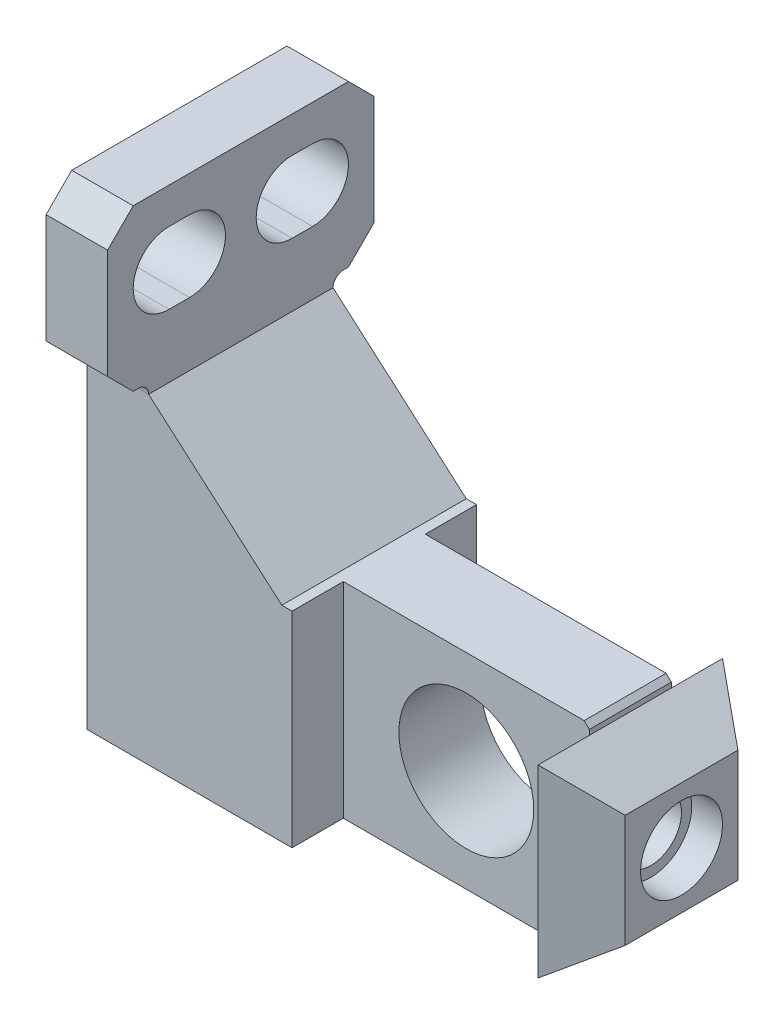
ISO-10303-21;
HEADER;
FILE_DESCRIPTION(('STEP AP214'),'2;1');
FILE_NAME('part.step','',(''),(''),'','','');
FILE_SCHEMA(('AUTOMOTIVE_DESIGN { 1 0 10303 214 1 1 1 1 }'));
ENDSEC;
DATA;
#1=APPLICATION_CONTEXT('core data for automotive mechanical design processes');
#2=APPLICATION_PROTOCOL_DEFINITION('international standard','automotive_design',2000,#1);
#3=PRODUCT_CONTEXT('',#1,'mechanical');
#4=PRODUCT('Part','Part','',(#3));
#5=PRODUCT_RELATED_PRODUCT_CATEGORY('part','',(#4));
#6=PRODUCT_DEFINITION_FORMATION('','',#4);
#7=PRODUCT_DEFINITION_CONTEXT('part definition',#1,'design');
#8=PRODUCT_DEFINITION('design','',#6,#7);
#9=PRODUCT_DEFINITION_SHAPE('','',#8);
#10=(LENGTH_UNIT() NAMED_UNIT(*) SI_UNIT(.MILLI.,.METRE.));
#11=(NAMED_UNIT(*) PLANE_ANGLE_UNIT() SI_UNIT($,.RADIAN.));
#12=(NAMED_UNIT(*) SI_UNIT($,.STERADIAN.) SOLID_ANGLE_UNIT());
#13=UNCERTAINTY_MEASURE_WITH_UNIT(LENGTH_MEASURE(1.E-05),#10,'distance_accuracy_value','');
#14=(GEOMETRIC_REPRESENTATION_CONTEXT(3) GLOBAL_UNCERTAINTY_ASSIGNED_CONTEXT((#13)) GLOBAL_UNIT_ASSIGNED_CONTEXT((#10,
#11,#12)) REPRESENTATION_CONTEXT('',''));
#15=CARTESIAN_POINT('',(0.,0.,0.));
#16=DIRECTION('',(0.,0.,1.));
#17=DIRECTION('',(1.,0.,0.));
#18=AXIS2_PLACEMENT_3D('',#15,#16,#17);
#19=CARTESIAN_POINT('',(12.,-9.5,4.));
#20=DIRECTION('',(-1.,0.,0.));
#21=DIRECTION('',(0.,0.,1.));
#22=AXIS2_PLACEMENT_3D('',#19,#20,#21);
#23=PLANE('',#22);
#24=DIRECTION('',(0.,0.,-1.));
#25=VECTOR('',#24,1.);
#26=CARTESIAN_POINT('',(12.,-9.,9.));
#27=LINE('',#26,#25);
#28=CARTESIAN_POINT('',(12.,-9.,4.));
#29=VERTEX_POINT('',#28);
#30=CARTESIAN_POINT('',(12.,-9.,-4.));
#31=VERTEX_POINT('',#30);
#32=EDGE_CURVE('E44',#29,#31,#27,.T.);
#33=ORIENTED_EDGE('',*,*,#32,.F.);
#34=DIRECTION('',(0.,1.,0.));
#35=VECTOR('',#34,1.);
#36=CARTESIAN_POINT('',(12.,-9.5,4.));
#37=LINE('',#36,#35);
#38=CARTESIAN_POINT('',(12.,-9.5,4.));
#39=VERTEX_POINT('',#38);
#40=EDGE_CURVE('E540',#39,#29,#37,.T.);
#41=ORIENTED_EDGE('',*,*,#40,.F.);
#42=DIRECTION('',(0.,0.,-1.));
#43=VECTOR('',#42,1.);
#44=CARTESIAN_POINT('',(12.,-9.5,4.));
#45=LINE('',#44,#43);
#46=CARTESIAN_POINT('',(12.,-9.5,-4.));
#47=VERTEX_POINT('',#46);
#48=EDGE_CURVE('E552',#39,#47,#45,.T.);
#49=ORIENTED_EDGE('',*,*,#48,.T.);
#50=DIRECTION('',(0.,1.,0.));
#51=VECTOR('',#50,1.);
#52=CARTESIAN_POINT('',(12.,-9.5,-4.));
#53=LINE('',#52,#51);
#54=EDGE_CURVE('E524',#47,#31,#53,.T.);
#55=ORIENTED_EDGE('',*,*,#54,.T.);
#56=EDGE_LOOP('',(#33,#41,#49,#55));
#57=FACE_BOUND('',#56,.T.);
#58=ADVANCED_FACE('F35',(#57),#23,.F.);
#59=CARTESIAN_POINT('',(-12.,-10.,4.));
#60=DIRECTION('',(0.,1.,0.));
#61=DIRECTION('',(0.,0.,1.));
#62=AXIS2_PLACEMENT_3D('',#59,#60,#61);
#63=PLANE('',#62);
#64=DIRECTION('',(1.,0.,0.));
#65=VECTOR('',#64,1.);
#66=CARTESIAN_POINT('',(-12.,-10.,4.));
#67=LINE('',#66,#65);
#68=CARTESIAN_POINT('',(-12.,-10.,4.));
#69=VERTEX_POINT('',#68);
#70=CARTESIAN_POINT('',(11.5,-10.,4.));
#71=VERTEX_POINT('',#70);
#72=EDGE_CURVE('E536',#69,#71,#67,.T.);
#73=ORIENTED_EDGE('',*,*,#72,.F.);
#74=DIRECTION('',(0.,0.,-1.));
#75=VECTOR('',#74,1.);
#76=CARTESIAN_POINT('',(-12.,-10.,9.));
#77=LINE('',#76,#75);
#78=CARTESIAN_POINT('',(-12.,-10.,9.));
#79=VERTEX_POINT('',#78);
#80=EDGE_CURVE('E460',#79,#69,#77,.T.);
#81=ORIENTED_EDGE('',*,*,#80,.F.);
#82=DIRECTION('',(1.,0.,0.));
#83=VECTOR('',#82,1.);
#84=CARTESIAN_POINT('',(-32.,-10.,9.));
#85=LINE('',#84,#83);
#86=CARTESIAN_POINT('',(-32.,-10.,9.));
#87=VERTEX_POINT('',#86);
#88=EDGE_CURVE('E442',#87,#79,#85,.T.);
#89=ORIENTED_EDGE('',*,*,#88,.F.);
#90=DIRECTION('',(0.,0.,-1.));
#91=VECTOR('',#90,1.);
#92=CARTESIAN_POINT('',(-32.,-10.,9.));
#93=LINE('',#92,#91);
#94=CARTESIAN_POINT('',(-32.,-10.,-9.));
#95=VERTEX_POINT('',#94);
#96=EDGE_CURVE('E462',#87,#95,#93,.T.);
#97=ORIENTED_EDGE('',*,*,#96,.T.);
#98=DIRECTION('',(1.,0.,0.));
#99=VECTOR('',#98,1.);
#100=CARTESIAN_POINT('',(-32.,-10.,-9.));
#101=LINE('',#100,#99);
#102=CARTESIAN_POINT('',(-12.,-10.,-9.));
#103=VERTEX_POINT('',#102);
#104=EDGE_CURVE('E425',#95,#103,#101,.T.);
#105=ORIENTED_EDGE('',*,*,#104,.T.);
#106=CARTESIAN_POINT('',(-12.,-10.,-4.));
#107=VERTEX_POINT('',#106);
#108=EDGE_CURVE('E459',#107,#103,#77,.T.);
#109=ORIENTED_EDGE('',*,*,#108,.F.);
#110=DIRECTION('',(1.,0.,0.));
#111=VECTOR('',#110,1.);
#112=CARTESIAN_POINT('',(-12.,-10.,-4.));
#113=LINE('',#112,#111);
#114=CARTESIAN_POINT('',(11.5,-10.,-4.));
#115=VERTEX_POINT('',#114);
#116=EDGE_CURVE('E517',#107,#115,#113,.T.);
#117=ORIENTED_EDGE('',*,*,#116,.T.);
#118=DIRECTION('',(0.,0.,-1.));
#119=VECTOR('',#118,1.);
#120=CARTESIAN_POINT('',(11.5,-10.,4.));
#121=LINE('',#120,#119);
#122=EDGE_CURVE('E39',#71,#115,#121,.T.);
#123=ORIENTED_EDGE('',*,*,#122,.F.);
#124=EDGE_LOOP('',(#73,#81,#89,#97,#105,#109,#117,#123));
#125=FACE_BOUND('',#124,.T.);
#126=ADVANCED_FACE('F37',(#125),#63,.F.);
#127=CARTESIAN_POINT('',(11.5,-10.,4.));
#128=DIRECTION('',(-0.707106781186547,0.707106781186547,0.));
#129=DIRECTION('',(-0.707106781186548,-0.707106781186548,0.));
#130=AXIS2_PLACEMENT_3D('',#127,#128,#129);
#131=PLANE('',#130);
#132=ORIENTED_EDGE('',*,*,#122,.T.);
#133=DIRECTION('',(0.707106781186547,0.707106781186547,0.));
#134=VECTOR('',#133,1.);
#135=CARTESIAN_POINT('',(11.5,-10.,-4.));
#136=LINE('',#135,#134);
#137=EDGE_CURVE('E520',#115,#47,#136,.T.);
#138=ORIENTED_EDGE('',*,*,#137,.T.);
#139=ORIENTED_EDGE('',*,*,#48,.F.);
#140=DIRECTION('',(0.707106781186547,0.707106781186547,0.));
#141=VECTOR('',#140,1.);
#142=CARTESIAN_POINT('',(11.5,-10.,4.));
#143=LINE('',#142,#141);
#144=EDGE_CURVE('E538',#71,#39,#143,.T.);
#145=ORIENTED_EDGE('',*,*,#144,.F.);
#146=EDGE_LOOP('',(#132,#138,#139,#145));
#147=FACE_BOUND('',#146,.T.);
#148=ADVANCED_FACE('F609',(#147),#131,.F.);
#149=CARTESIAN_POINT('',(12.,9.,4.));
#150=VERTEX_POINT('',#149);
#151=CARTESIAN_POINT('',(12.,9.5,4.));
#152=VERTEX_POINT('',#151);
#153=EDGE_CURVE('E53',#150,#152,#37,.T.);
#154=ORIENTED_EDGE('',*,*,#153,.F.);
#155=DIRECTION('',(0.,0.,-1.));
#156=VECTOR('',#155,1.);
#157=CARTESIAN_POINT('',(12.,9.,9.));
#158=LINE('',#157,#156);
#159=CARTESIAN_POINT('',(12.,9.,-4.));
#160=VERTEX_POINT('',#159);
#161=EDGE_CURVE('E11',#150,#160,#158,.T.);
#162=ORIENTED_EDGE('',*,*,#161,.T.);
#163=CARTESIAN_POINT('',(12.,9.5,-4.));
#164=VERTEX_POINT('',#163);
#165=EDGE_CURVE('E523',#160,#164,#53,.T.);
#166=ORIENTED_EDGE('',*,*,#165,.T.);
#167=DIRECTION('',(0.,0.,-1.));
#168=VECTOR('',#167,1.);
#169=CARTESIAN_POINT('',(12.,9.5,4.));
#170=LINE('',#169,#168);
#171=EDGE_CURVE('E550',#152,#164,#170,.T.);
#172=ORIENTED_EDGE('',*,*,#171,.F.);
#173=EDGE_LOOP('',(#154,#162,#166,#172));
#174=FACE_BOUND('',#173,.T.);
#175=ADVANCED_FACE('F589',(#174),#23,.F.);
#176=CARTESIAN_POINT('',(12.,9.5,4.));
#177=DIRECTION('',(-0.707106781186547,-0.707106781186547,0.));
#178=DIRECTION('',(0.707106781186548,-0.707106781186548,0.));
#179=AXIS2_PLACEMENT_3D('',#176,#177,#178);
#180=PLANE('',#179);
#181=ORIENTED_EDGE('',*,*,#171,.T.);
#182=DIRECTION('',(-0.707106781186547,0.707106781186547,0.));
#183=VECTOR('',#182,1.);
#184=CARTESIAN_POINT('',(12.,9.5,-4.));
#185=LINE('',#184,#183);
#186=CARTESIAN_POINT('',(11.5,10.,-4.));
#187=VERTEX_POINT('',#186);
#188=EDGE_CURVE('E526',#164,#187,#185,.T.);
#189=ORIENTED_EDGE('',*,*,#188,.T.);
#190=DIRECTION('',(0.,0.,-1.));
#191=VECTOR('',#190,1.);
#192=CARTESIAN_POINT('',(11.5,10.,4.));
#193=LINE('',#192,#191);
#194=CARTESIAN_POINT('',(11.5,10.,4.));
#195=VERTEX_POINT('',#194);
#196=EDGE_CURVE('E548',#195,#187,#193,.T.);
#197=ORIENTED_EDGE('',*,*,#196,.F.);
#198=DIRECTION('',(-0.707106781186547,0.707106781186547,0.));
#199=VECTOR('',#198,1.);
#200=CARTESIAN_POINT('',(12.,9.5,4.));
#201=LINE('',#200,#199);
#202=EDGE_CURVE('E542',#152,#195,#201,.T.);
#203=ORIENTED_EDGE('',*,*,#202,.F.);
#204=EDGE_LOOP('',(#181,#189,#197,#203));
#205=FACE_BOUND('',#204,.T.);
#206=ADVANCED_FACE('F593',(#205),#180,.F.);
#207=CARTESIAN_POINT('',(11.5,10.,4.));
#208=DIRECTION('',(0.,-1.,0.));
#209=DIRECTION('',(0.,0.,-1.));
#210=AXIS2_PLACEMENT_3D('',#207,#208,#209);
#211=PLANE('',#210);
#212=ORIENTED_EDGE('',*,*,#196,.T.);
#213=DIRECTION('',(-1.,0.,0.));
#214=VECTOR('',#213,1.);
#215=CARTESIAN_POINT('',(11.5,10.,-4.));
#216=LINE('',#215,#214);
#217=CARTESIAN_POINT('',(-12.,10.,-4.));
#218=VERTEX_POINT('',#217);
#219=EDGE_CURVE('E530',#187,#218,#216,.T.);
#220=ORIENTED_EDGE('',*,*,#219,.T.);
#221=DIRECTION('',(0.,0.,-1.));
#222=VECTOR('',#221,1.);
#223=CARTESIAN_POINT('',(-12.,10.,9.));
#224=LINE('',#223,#222);
#225=CARTESIAN_POINT('',(-12.,10.,-9.));
#226=VERTEX_POINT('',#225);
#227=EDGE_CURVE('E455',#218,#226,#224,.T.);
#228=ORIENTED_EDGE('',*,*,#227,.T.);
#229=DIRECTION('',(-1.,0.,0.));
#230=VECTOR('',#229,1.);
#231=CARTESIAN_POINT('',(-12.,10.,-9.));
#232=LINE('',#231,#230);
#233=CARTESIAN_POINT('',(-13.,10.,-9.));
#234=VERTEX_POINT('',#233);
#235=EDGE_CURVE('E431',#226,#234,#232,.T.);
#236=ORIENTED_EDGE('',*,*,#235,.T.);
#237=DIRECTION('',(0.,0.,-1.));
#238=VECTOR('',#237,1.);
#239=CARTESIAN_POINT('',(-13.,10.,9.));
#240=LINE('',#239,#238);
#241=CARTESIAN_POINT('',(-13.,10.,9.));
#242=VERTEX_POINT('',#241);
#243=EDGE_CURVE('E453',#242,#234,#240,.T.);
#244=ORIENTED_EDGE('',*,*,#243,.F.);
#245=DIRECTION('',(-1.,0.,0.));
#246=VECTOR('',#245,1.);
#247=CARTESIAN_POINT('',(-12.,10.,9.));
#248=LINE('',#247,#246);
#249=CARTESIAN_POINT('',(-12.,10.,9.));
#250=VERTEX_POINT('',#249);
#251=EDGE_CURVE('E446',#250,#242,#248,.T.);
#252=ORIENTED_EDGE('',*,*,#251,.F.);
#253=CARTESIAN_POINT('',(-12.,10.,4.));
#254=VERTEX_POINT('',#253);
#255=EDGE_CURVE('E456',#250,#254,#224,.T.);
#256=ORIENTED_EDGE('',*,*,#255,.T.);
#257=DIRECTION('',(-1.,0.,0.));
#258=VECTOR('',#257,1.);
#259=CARTESIAN_POINT('',(11.5,10.,4.));
#260=LINE('',#259,#258);
#261=EDGE_CURVE('E545',#195,#254,#260,.T.);
#262=ORIENTED_EDGE('',*,*,#261,.F.);
#263=EDGE_LOOP('',(#212,#220,#228,#236,#244,#252,#256,#262));
#264=FACE_BOUND('',#263,.T.);
#265=ADVANCED_FACE('F597',(#264),#211,.F.);
#266=CARTESIAN_POINT('',(0.,0.,4.));
#267=DIRECTION('',(0.,0.,1.));
#268=DIRECTION('',(1.,0.,0.));
#269=AXIS2_PLACEMENT_3D('',#266,#267,#268);
#270=PLANE('',#269);
#271=CARTESIAN_POINT('',(0.,0.,4.));
#272=DIRECTION('',(0.,0.,1.));
#273=DIRECTION('',(1.,0.,0.));
#274=AXIS2_PLACEMENT_3D('',#271,#272,#273);
#275=CIRCLE('',#274,6.5785);
#276=CARTESIAN_POINT('',(6.5785,0.,4.));
#277=VERTEX_POINT('',#276);
#278=EDGE_CURVE('E512',#277,#277,#275,.T.);
#279=ORIENTED_EDGE('',*,*,#278,.F.);
#280=EDGE_LOOP('',(#279));
#281=FACE_BOUND('',#280,.T.);
#282=DIRECTION('',(0.,-1.,0.));
#283=VECTOR('',#282,1.);
#284=CARTESIAN_POINT('',(-12.,10.,4.));
#285=LINE('',#284,#283);
#286=EDGE_CURVE('E533',#254,#69,#285,.T.);
#287=ORIENTED_EDGE('',*,*,#286,.T.);
#288=ORIENTED_EDGE('',*,*,#72,.T.);
#289=ORIENTED_EDGE('',*,*,#144,.T.);
#290=ORIENTED_EDGE('',*,*,#40,.T.);
#291=EDGE_CURVE('E543',#29,#150,#37,.T.);
#292=ORIENTED_EDGE('',*,*,#291,.T.);
#293=ORIENTED_EDGE('',*,*,#153,.T.);
#294=ORIENTED_EDGE('',*,*,#202,.T.);
#295=ORIENTED_EDGE('',*,*,#261,.T.);
#296=EDGE_LOOP('',(#287,#288,#289,#290,#292,#293,#294,#295));
#297=FACE_BOUND('',#296,.T.);
#298=ADVANCED_FACE('F586',(#281,#297),#270,.T.);
#299=CARTESIAN_POINT('',(0.,0.,-4.));
#300=DIRECTION('',(0.,0.,1.));
#301=DIRECTION('',(1.,0.,0.));
#302=AXIS2_PLACEMENT_3D('',#299,#300,#301);
#303=PLANE('',#302);
#304=CARTESIAN_POINT('',(0.,0.,-4.));
#305=DIRECTION('',(0.,0.,1.));
#306=DIRECTION('',(1.,0.,0.));
#307=AXIS2_PLACEMENT_3D('',#304,#305,#306);
#308=CIRCLE('',#307,6.5785);
#309=CARTESIAN_POINT('',(6.5785,0.,-4.));
#310=VERTEX_POINT('',#309);
#311=EDGE_CURVE('E509',#310,#310,#308,.T.);
#312=ORIENTED_EDGE('',*,*,#311,.T.);
#313=EDGE_LOOP('',(#312));
#314=FACE_BOUND('',#313,.T.);
#315=DIRECTION('',(0.,-1.,0.));
#316=VECTOR('',#315,1.);
#317=CARTESIAN_POINT('',(-12.,10.,-4.));
#318=LINE('',#317,#316);
#319=EDGE_CURVE('E515',#218,#107,#318,.T.);
#320=ORIENTED_EDGE('',*,*,#319,.F.);
#321=ORIENTED_EDGE('',*,*,#219,.F.);
#322=ORIENTED_EDGE('',*,*,#188,.F.);
#323=ORIENTED_EDGE('',*,*,#165,.F.);
#324=EDGE_CURVE('E527',#31,#160,#53,.T.);
#325=ORIENTED_EDGE('',*,*,#324,.F.);
#326=ORIENTED_EDGE('',*,*,#54,.F.);
#327=ORIENTED_EDGE('',*,*,#137,.F.);
#328=ORIENTED_EDGE('',*,*,#116,.F.);
#329=EDGE_LOOP('',(#320,#321,#322,#323,#325,#326,#327,#328));
#330=FACE_BOUND('',#329,.T.);
#331=ADVANCED_FACE('F860',(#314,#330),#303,.F.);
#332=CARTESIAN_POINT('',(0.,0.,-4.));
#333=DIRECTION('',(0.,0.,1.));
#334=DIRECTION('',(1.,0.,0.));
#335=AXIS2_PLACEMENT_3D('',#332,#333,#334);
#336=CYLINDRICAL_SURFACE('',#335,6.5785);
#337=ORIENTED_EDGE('',*,*,#278,.T.);
#338=EDGE_LOOP('',(#337));
#339=FACE_BOUND('',#338,.T.);
#340=ORIENTED_EDGE('',*,*,#311,.F.);
#341=EDGE_LOOP('',(#340));
#342=FACE_BOUND('',#341,.T.);
#343=ADVANCED_FACE('F853',(#339,#342),#336,.F.);
#344=CARTESIAN_POINT('',(12.,9.,9.));
#345=DIRECTION('',(1.,0.,0.));
#346=DIRECTION('',(0.,0.,-1.));
#347=AXIS2_PLACEMENT_3D('',#344,#345,#346);
#348=PLANE('',#347);
#349=CARTESIAN_POINT('',(12.,-9.,-9.));
#350=VERTEX_POINT('',#349);
#351=EDGE_CURVE('E504',#31,#350,#27,.T.);
#352=ORIENTED_EDGE('',*,*,#351,.F.);
#353=ORIENTED_EDGE('',*,*,#324,.T.);
#354=CARTESIAN_POINT('',(12.,9.,-9.));
#355=VERTEX_POINT('',#354);
#356=EDGE_CURVE('E47',#160,#355,#158,.T.);
#357=ORIENTED_EDGE('',*,*,#356,.T.);
#358=DIRECTION('',(0.,-1.,0.));
#359=VECTOR('',#358,1.);
#360=CARTESIAN_POINT('',(12.,9.,-9.));
#361=LINE('',#360,#359);
#362=EDGE_CURVE('E493',#355,#350,#361,.T.);
#363=ORIENTED_EDGE('',*,*,#362,.T.);
#364=EDGE_LOOP('',(#352,#353,#357,#363));
#365=FACE_BOUND('',#364,.T.);
#366=ADVANCED_FACE('F567',(#365),#348,.F.);
#367=CARTESIAN_POINT('',(17.,5.50000000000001,9.));
#368=DIRECTION('',(-0.573462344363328,-0.819231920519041,0.));
#369=DIRECTION('',(0.819231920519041,-0.573462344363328,0.));
#370=AXIS2_PLACEMENT_3D('',#367,#368,#369);
#371=PLANE('',#370);
#372=CARTESIAN_POINT('',(12.,9.,9.));
#373=VERTEX_POINT('',#372);
#374=EDGE_CURVE('E46',#373,#150,#158,.T.);
#375=ORIENTED_EDGE('',*,*,#374,.F.);
#376=DIRECTION('',(0.710669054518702,-0.49746833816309,-0.497468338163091));
#377=VECTOR('',#376,1.);
#378=CARTESIAN_POINT('',(15.7626262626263,6.36616161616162,6.36616161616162));
#379=LINE('',#378,#377);
#380=CARTESIAN_POINT('',(17.,5.50000000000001,5.5));
#381=VERTEX_POINT('',#380);
#382=EDGE_CURVE('E490',#373,#381,#379,.T.);
#383=ORIENTED_EDGE('',*,*,#382,.T.);
#384=DIRECTION('',(0.,0.,-1.));
#385=VECTOR('',#384,1.);
#386=CARTESIAN_POINT('',(17.,5.50000000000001,9.));
#387=LINE('',#386,#385);
#388=CARTESIAN_POINT('',(17.,5.50000000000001,-5.50000000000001));
#389=VERTEX_POINT('',#388);
#390=EDGE_CURVE('E498',#381,#389,#387,.T.);
#391=ORIENTED_EDGE('',*,*,#390,.T.);
#392=DIRECTION('',(-0.710669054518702,0.49746833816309,-0.49746833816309));
#393=VECTOR('',#392,1.);
#394=CARTESIAN_POINT('',(22.1262626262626,1.91161616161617,-1.91161616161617));
#395=LINE('',#394,#393);
#396=EDGE_CURVE('E484',#389,#355,#395,.T.);
#397=ORIENTED_EDGE('',*,*,#396,.T.);
#398=ORIENTED_EDGE('',*,*,#356,.F.);
#399=ORIENTED_EDGE('',*,*,#161,.F.);
#400=EDGE_LOOP('',(#375,#383,#391,#397,#398,#399));
#401=FACE_BOUND('',#400,.T.);
#402=ADVANCED_FACE('F573',(#401),#371,.F.);
#403=ORIENTED_EDGE('',*,*,#291,.F.);
#404=CARTESIAN_POINT('',(12.,-9.,9.));
#405=VERTEX_POINT('',#404);
#406=EDGE_CURVE('E505',#405,#29,#27,.T.);
#407=ORIENTED_EDGE('',*,*,#406,.F.);
#408=DIRECTION('',(0.,-1.,0.));
#409=VECTOR('',#408,1.);
#410=CARTESIAN_POINT('',(12.,9.,9.));
#411=LINE('',#410,#409);
#412=EDGE_CURVE('E496',#373,#405,#411,.T.);
#413=ORIENTED_EDGE('',*,*,#412,.F.);
#414=ORIENTED_EDGE('',*,*,#374,.T.);
#415=EDGE_LOOP('',(#403,#407,#413,#414));
#416=FACE_BOUND('',#415,.T.);
#417=ADVANCED_FACE('F584',(#416),#348,.F.);
#418=CARTESIAN_POINT('',(12.,-9.,9.));
#419=DIRECTION('',(-0.573462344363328,0.81923192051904,0.));
#420=DIRECTION('',(-0.81923192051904,-0.573462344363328,0.));
#421=AXIS2_PLACEMENT_3D('',#418,#419,#420);
#422=PLANE('',#421);
#423=DIRECTION('',(0.,0.,-1.));
#424=VECTOR('',#423,1.);
#425=CARTESIAN_POINT('',(17.,-5.5,9.));
#426=LINE('',#425,#424);
#427=CARTESIAN_POINT('',(17.,-5.5,5.5));
#428=VERTEX_POINT('',#427);
#429=CARTESIAN_POINT('',(17.,-5.5,-5.50000000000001));
#430=VERTEX_POINT('',#429);
#431=EDGE_CURVE('E501',#428,#430,#426,.T.);
#432=ORIENTED_EDGE('',*,*,#431,.F.);
#433=DIRECTION('',(-0.710669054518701,-0.497468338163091,0.497468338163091));
#434=VECTOR('',#433,1.);
#435=CARTESIAN_POINT('',(12.,-9.,9.));
#436=LINE('',#435,#434);
#437=EDGE_CURVE('E487',#428,#405,#436,.T.);
#438=ORIENTED_EDGE('',*,*,#437,.T.);
#439=ORIENTED_EDGE('',*,*,#406,.T.);
#440=ORIENTED_EDGE('',*,*,#32,.T.);
#441=ORIENTED_EDGE('',*,*,#351,.T.);
#442=DIRECTION('',(0.710669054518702,0.497468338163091,0.49746833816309));
#443=VECTOR('',#442,1.);
#444=CARTESIAN_POINT('',(18.3636363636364,-4.54545454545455,-4.54545454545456));
#445=LINE('',#444,#443);
#446=EDGE_CURVE('E479',#350,#430,#445,.T.);
#447=ORIENTED_EDGE('',*,*,#446,.T.);
#448=EDGE_LOOP('',(#432,#438,#439,#440,#441,#447));
#449=FACE_BOUND('',#448,.T.);
#450=ADVANCED_FACE('F563',(#449),#422,.F.);
#451=CARTESIAN_POINT('',(17.,-5.5,9.));
#452=DIRECTION('',(-1.,0.,0.));
#453=DIRECTION('',(0.,0.,1.));
#454=AXIS2_PLACEMENT_3D('',#451,#452,#453);
#455=PLANE('',#454);
#456=CARTESIAN_POINT('',(17.,0.,0.));
#457=DIRECTION('',(-1.,0.,0.));
#458=DIRECTION('',(0.,0.,1.));
#459=AXIS2_PLACEMENT_3D('',#456,#457,#458);
#460=CIRCLE('',#459,4.);
#461=CARTESIAN_POINT('',(17.,0.,4.));
#462=VERTEX_POINT('',#461);
#463=EDGE_CURVE('E464',#462,#462,#460,.T.);
#464=ORIENTED_EDGE('',*,*,#463,.T.);
#465=EDGE_LOOP('',(#464));
#466=FACE_BOUND('',#465,.T.);
#467=ORIENTED_EDGE('',*,*,#390,.F.);
#468=DIRECTION('',(0.,1.,0.));
#469=VECTOR('',#468,1.);
#470=CARTESIAN_POINT('',(17.,-9.,5.5));
#471=LINE('',#470,#469);
#472=EDGE_CURVE('E477',#428,#381,#471,.T.);
#473=ORIENTED_EDGE('',*,*,#472,.F.);
#474=ORIENTED_EDGE('',*,*,#431,.T.);
#475=DIRECTION('',(0.,1.,0.));
#476=VECTOR('',#475,1.);
#477=CARTESIAN_POINT('',(17.,-9.,-5.50000000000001));
#478=LINE('',#477,#476);
#479=EDGE_CURVE('E476',#430,#389,#478,.T.);
#480=ORIENTED_EDGE('',*,*,#479,.T.);
#481=EDGE_LOOP('',(#467,#473,#474,#480));
#482=FACE_BOUND('',#481,.T.);
#483=ADVANCED_FACE('F578',(#466,#482),#455,.F.);
#484=CARTESIAN_POINT('',(12.,-9.,-9.));
#485=DIRECTION('',(-0.573462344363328,0.,0.819231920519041));
#486=DIRECTION('',(0.819231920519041,0.,0.573462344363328));
#487=AXIS2_PLACEMENT_3D('',#484,#485,#486);
#488=PLANE('',#487);
#489=ORIENTED_EDGE('',*,*,#479,.F.);
#490=ORIENTED_EDGE('',*,*,#446,.F.);
#491=ORIENTED_EDGE('',*,*,#362,.F.);
#492=ORIENTED_EDGE('',*,*,#396,.F.);
#493=EDGE_LOOP('',(#489,#490,#491,#492));
#494=FACE_BOUND('',#493,.T.);
#495=ADVANCED_FACE('F570',(#494),#488,.F.);
#496=CARTESIAN_POINT('',(17.,-9.,5.5));
#497=DIRECTION('',(-0.573462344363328,0.,-0.81923192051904));
#498=DIRECTION('',(-0.81923192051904,0.,0.573462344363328));
#499=AXIS2_PLACEMENT_3D('',#496,#497,#498);
#500=PLANE('',#499);
#501=ORIENTED_EDGE('',*,*,#412,.T.);
#502=ORIENTED_EDGE('',*,*,#437,.F.);
#503=ORIENTED_EDGE('',*,*,#472,.T.);
#504=ORIENTED_EDGE('',*,*,#382,.F.);
#505=EDGE_LOOP('',(#501,#502,#503,#504));
#506=FACE_BOUND('',#505,.T.);
#507=ADVANCED_FACE('F637',(#506),#500,.F.);
#508=CARTESIAN_POINT('',(9.,0.,0.));
#509=DIRECTION('',(1.,0.,0.));
#510=DIRECTION('',(0.,0.,-1.));
#511=AXIS2_PLACEMENT_3D('',#508,#509,#510);
#512=PLANE('',#511);
#513=CARTESIAN_POINT('',(9.,0.,0.));
#514=DIRECTION('',(-1.,0.,0.));
#515=DIRECTION('',(0.,0.,1.));
#516=AXIS2_PLACEMENT_3D('',#513,#514,#515);
#517=CIRCLE('',#516,3.);
#518=CARTESIAN_POINT('',(9.,0.,3.));
#519=VERTEX_POINT('',#518);
#520=EDGE_CURVE('E473',#519,#519,#517,.T.);
#521=ORIENTED_EDGE('',*,*,#520,.F.);
#522=EDGE_LOOP('',(#521));
#523=FACE_BOUND('',#522,.T.);
#524=ADVANCED_FACE('F670',(#523),#512,.T.);
#525=CARTESIAN_POINT('',(17.,0.,0.));
#526=DIRECTION('',(-1.,0.,0.));
#527=DIRECTION('',(0.,0.,1.));
#528=AXIS2_PLACEMENT_3D('',#525,#526,#527);
#529=CYLINDRICAL_SURFACE('',#528,3.);
#530=ORIENTED_EDGE('',*,*,#520,.T.);
#531=EDGE_LOOP('',(#530));
#532=FACE_BOUND('',#531,.T.);
#533=CARTESIAN_POINT('',(14.,0.,0.));
#534=DIRECTION('',(-1.,0.,0.));
#535=DIRECTION('',(0.,0.,1.));
#536=AXIS2_PLACEMENT_3D('',#533,#534,#535);
#537=CIRCLE('',#536,3.);
#538=CARTESIAN_POINT('',(14.,0.,3.));
#539=VERTEX_POINT('',#538);
#540=EDGE_CURVE('E470',#539,#539,#537,.T.);
#541=ORIENTED_EDGE('',*,*,#540,.F.);
#542=EDGE_LOOP('',(#541));
#543=FACE_BOUND('',#542,.T.);
#544=ADVANCED_FACE('F674',(#532,#543),#529,.F.);
#545=CARTESIAN_POINT('',(14.,3.,0.));
#546=DIRECTION('',(1.,0.,0.));
#547=DIRECTION('',(0.,0.,-1.));
#548=AXIS2_PLACEMENT_3D('',#545,#546,#547);
#549=PLANE('',#548);
#550=ORIENTED_EDGE('',*,*,#540,.T.);
#551=EDGE_LOOP('',(#550));
#552=FACE_BOUND('',#551,.T.);
#553=CARTESIAN_POINT('',(14.,0.,0.));
#554=DIRECTION('',(-1.,0.,0.));
#555=DIRECTION('',(0.,0.,1.));
#556=AXIS2_PLACEMENT_3D('',#553,#554,#555);
#557=CIRCLE('',#556,4.);
#558=CARTESIAN_POINT('',(14.,0.,4.));
#559=VERTEX_POINT('',#558);
#560=EDGE_CURVE('E467',#559,#559,#557,.T.);
#561=ORIENTED_EDGE('',*,*,#560,.F.);
#562=EDGE_LOOP('',(#561));
#563=FACE_BOUND('',#562,.T.);
#564=ADVANCED_FACE('F688',(#552,#563),#549,.T.);
#565=CARTESIAN_POINT('',(17.,0.,0.));
#566=DIRECTION('',(-1.,0.,0.));
#567=DIRECTION('',(0.,0.,1.));
#568=AXIS2_PLACEMENT_3D('',#565,#566,#567);
#569=CYLINDRICAL_SURFACE('',#568,4.);
#570=ORIENTED_EDGE('',*,*,#560,.T.);
#571=EDGE_LOOP('',(#570));
#572=FACE_BOUND('',#571,.T.);
#573=ORIENTED_EDGE('',*,*,#463,.F.);
#574=EDGE_LOOP('',(#573));
#575=FACE_BOUND('',#574,.T.);
#576=ADVANCED_FACE('F697',(#572,#575),#569,.F.);
#577=CARTESIAN_POINT('',(-12.,-10.,9.));
#578=DIRECTION('',(-1.,0.,0.));
#579=DIRECTION('',(0.,0.,1.));
#580=AXIS2_PLACEMENT_3D('',#577,#578,#579);
#581=PLANE('',#580);
#582=ORIENTED_EDGE('',*,*,#227,.F.);
#583=ORIENTED_EDGE('',*,*,#319,.T.);
#584=ORIENTED_EDGE('',*,*,#108,.T.);
#585=DIRECTION('',(0.,1.,0.));
#586=VECTOR('',#585,1.);
#587=CARTESIAN_POINT('',(-12.,-10.,-9.));
#588=LINE('',#587,#586);
#589=EDGE_CURVE('E428',#103,#226,#588,.T.);
#590=ORIENTED_EDGE('',*,*,#589,.T.);
#591=EDGE_LOOP('',(#582,#583,#584,#590));
#592=FACE_BOUND('',#591,.T.);
#593=ADVANCED_FACE('F706',(#592),#581,.F.);
#594=CARTESIAN_POINT('',(-32.,21.32,9.));
#595=DIRECTION('',(1.,0.,0.));
#596=DIRECTION('',(0.,0.,-1.));
#597=AXIS2_PLACEMENT_3D('',#594,#595,#596);
#598=PLANE('',#597);
#599=DIRECTION('',(0.,-1.,0.));
#600=VECTOR('',#599,1.);
#601=CARTESIAN_POINT('',(-32.,21.32,9.));
#602=LINE('',#601,#600);
#603=CARTESIAN_POINT('',(-32.,21.32,9.));
#604=VERTEX_POINT('',#603);
#605=EDGE_CURVE('E440',#604,#87,#602,.T.);
#606=ORIENTED_EDGE('',*,*,#605,.F.);
#607=CARTESIAN_POINT('',(-32.,21.32,10.));
#608=DIRECTION('',(-1.,0.,0.));
#609=DIRECTION('',(0.,0.,1.));
#610=AXIS2_PLACEMENT_3D('',#607,#608,#609);
#611=CIRCLE('',#610,0.999999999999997);
#612=CARTESIAN_POINT('',(-32.,22.32,10.));
#613=VERTEX_POINT('',#612);
#614=EDGE_CURVE('E378',#613,#604,#611,.T.);
#615=ORIENTED_EDGE('',*,*,#614,.F.);
#616=DIRECTION('',(0.,0.,-1.));
#617=VECTOR('',#616,1.);
#618=CARTESIAN_POINT('',(-32.,22.32,10.5));
#619=LINE('',#618,#617);
#620=CARTESIAN_POINT('',(-32.,22.32,10.5));
#621=VERTEX_POINT('',#620);
#622=EDGE_CURVE('E376',#621,#613,#619,.T.);
#623=ORIENTED_EDGE('',*,*,#622,.F.);
#624=DIRECTION('',(0.,-0.707106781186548,-0.707106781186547));
#625=VECTOR('',#624,1.);
#626=CARTESIAN_POINT('',(-32.,24.82,13.));
#627=LINE('',#626,#625);
#628=CARTESIAN_POINT('',(-32.,24.82,13.));
#629=VERTEX_POINT('',#628);
#630=EDGE_CURVE('E374',#629,#621,#627,.T.);
#631=ORIENTED_EDGE('',*,*,#630,.F.);
#632=DIRECTION('',(0.,-1.,0.));
#633=VECTOR('',#632,1.);
#634=CARTESIAN_POINT('',(-32.,35.5,13.));
#635=LINE('',#634,#633);
#636=CARTESIAN_POINT('',(-32.,35.5,13.));
#637=VERTEX_POINT('',#636);
#638=EDGE_CURVE('E372',#637,#629,#635,.T.);
#639=ORIENTED_EDGE('',*,*,#638,.F.);
#640=DIRECTION('',(0.,-0.707106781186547,0.707106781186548));
#641=VECTOR('',#640,1.);
#642=CARTESIAN_POINT('',(-32.,38.,10.5));
#643=LINE('',#642,#641);
#644=CARTESIAN_POINT('',(-32.,38.,10.5));
#645=VERTEX_POINT('',#644);
#646=EDGE_CURVE('E344',#645,#637,#643,.T.);
#647=ORIENTED_EDGE('',*,*,#646,.F.);
#648=DIRECTION('',(0.,0.,1.));
#649=VECTOR('',#648,1.);
#650=CARTESIAN_POINT('',(-32.,38.,-10.5));
#651=LINE('',#650,#649);
#652=CARTESIAN_POINT('',(-32.,38.,-10.5));
#653=VERTEX_POINT('',#652);
#654=EDGE_CURVE('E349',#653,#645,#651,.T.);
#655=ORIENTED_EDGE('',*,*,#654,.F.);
#656=DIRECTION('',(0.,0.707106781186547,0.707106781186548));
#657=VECTOR('',#656,1.);
#658=CARTESIAN_POINT('',(-32.,35.5,-13.));
#659=LINE('',#658,#657);
#660=CARTESIAN_POINT('',(-32.,35.5,-13.));
#661=VERTEX_POINT('',#660);
#662=EDGE_CURVE('E388',#661,#653,#659,.T.);
#663=ORIENTED_EDGE('',*,*,#662,.F.);
#664=DIRECTION('',(0.,1.,0.));
#665=VECTOR('',#664,1.);
#666=CARTESIAN_POINT('',(-32.,24.82,-13.));
#667=LINE('',#666,#665);
#668=CARTESIAN_POINT('',(-32.,24.82,-13.));
#669=VERTEX_POINT('',#668);
#670=EDGE_CURVE('E386',#669,#661,#667,.T.);
#671=ORIENTED_EDGE('',*,*,#670,.F.);
#672=DIRECTION('',(0.,0.707106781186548,-0.707106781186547));
#673=VECTOR('',#672,1.);
#674=CARTESIAN_POINT('',(-32.,22.32,-10.5));
#675=LINE('',#674,#673);
#676=CARTESIAN_POINT('',(-32.,22.32,-10.5));
#677=VERTEX_POINT('',#676);
#678=EDGE_CURVE('E384',#677,#669,#675,.T.);
#679=ORIENTED_EDGE('',*,*,#678,.F.);
#680=DIRECTION('',(0.,0.,-1.));
#681=VECTOR('',#680,1.);
#682=CARTESIAN_POINT('',(-32.,22.32,-10.));
#683=LINE('',#682,#681);
#684=CARTESIAN_POINT('',(-32.,22.32,-10.));
#685=VERTEX_POINT('',#684);
#686=EDGE_CURVE('E382',#685,#677,#683,.T.);
#687=ORIENTED_EDGE('',*,*,#686,.F.);
#688=CARTESIAN_POINT('',(-32.,21.32,-10.));
#689=DIRECTION('',(-1.,0.,0.));
#690=DIRECTION('',(0.,0.,1.));
#691=AXIS2_PLACEMENT_3D('',#688,#689,#690);
#692=CIRCLE('',#691,0.999999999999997);
#693=CARTESIAN_POINT('',(-32.,21.32,-9.));
#694=VERTEX_POINT('',#693);
#695=EDGE_CURVE('E380',#694,#685,#692,.T.);
#696=ORIENTED_EDGE('',*,*,#695,.F.);
#697=DIRECTION('',(0.,-1.,0.));
#698=VECTOR('',#697,1.);
#699=CARTESIAN_POINT('',(-32.,21.32,-9.));
#700=LINE('',#699,#698);
#701=EDGE_CURVE('E422',#694,#95,#700,.T.);
#702=ORIENTED_EDGE('',*,*,#701,.T.);
#703=ORIENTED_EDGE('',*,*,#96,.F.);
#704=EDGE_LOOP('',(#606,#615,#623,#631,#639,#647,#655,#663,#671,#679,#687,#696,#702,#703));
#705=FACE_BOUND('',#704,.T.);
#706=DIRECTION('',(0.,0.,1.));
#707=VECTOR('',#706,1.);
#708=CARTESIAN_POINT('',(-32.,34.5,-7.));
#709=LINE('',#708,#707);
#710=CARTESIAN_POINT('',(-32.,34.5,-7.));
#711=VERTEX_POINT('',#710);
#712=CARTESIAN_POINT('',(-32.,34.5,-5.));
#713=VERTEX_POINT('',#712);
#714=EDGE_CURVE('E317',#711,#713,#709,.T.);
#715=ORIENTED_EDGE('',*,*,#714,.T.);
#716=CARTESIAN_POINT('',(-32.,31.,-5.));
#717=DIRECTION('',(1.,0.,0.));
#718=DIRECTION('',(0.,0.,-1.));
#719=AXIS2_PLACEMENT_3D('',#716,#717,#718);
#720=CIRCLE('',#719,3.5);
#721=CARTESIAN_POINT('',(-32.,27.5,-5.));
#722=VERTEX_POINT('',#721);
#723=EDGE_CURVE('E290',#713,#722,#720,.T.);
#724=ORIENTED_EDGE('',*,*,#723,.T.);
#725=DIRECTION('',(0.,0.,-1.));
#726=VECTOR('',#725,1.);
#727=CARTESIAN_POINT('',(-32.,27.5,-5.));
#728=LINE('',#727,#726);
#729=CARTESIAN_POINT('',(-32.,27.5,-7.));
#730=VERTEX_POINT('',#729);
#731=EDGE_CURVE('E327',#722,#730,#728,.T.);
#732=ORIENTED_EDGE('',*,*,#731,.T.);
#733=CARTESIAN_POINT('',(-32.,31.,-7.));
#734=DIRECTION('',(1.,0.,0.));
#735=DIRECTION('',(0.,0.,-1.));
#736=AXIS2_PLACEMENT_3D('',#733,#734,#735);
#737=CIRCLE('',#736,3.5);
#738=EDGE_CURVE('E330',#730,#711,#737,.T.);
#739=ORIENTED_EDGE('',*,*,#738,.T.);
#740=EDGE_LOOP('',(#715,#724,#732,#739));
#741=FACE_BOUND('',#740,.T.);
#742=DIRECTION('',(0.,0.,1.));
#743=VECTOR('',#742,1.);
#744=CARTESIAN_POINT('',(-32.,34.5,5.));
#745=LINE('',#744,#743);
#746=CARTESIAN_POINT('',(-32.,34.5,5.));
#747=VERTEX_POINT('',#746);
#748=CARTESIAN_POINT('',(-32.,34.5,7.));
#749=VERTEX_POINT('',#748);
#750=EDGE_CURVE('E283',#747,#749,#745,.T.);
#751=ORIENTED_EDGE('',*,*,#750,.T.);
#752=CARTESIAN_POINT('',(-32.,31.,7.));
#753=DIRECTION('',(1.,0.,0.));
#754=DIRECTION('',(0.,0.,-1.));
#755=AXIS2_PLACEMENT_3D('',#752,#753,#754);
#756=CIRCLE('',#755,3.5);
#757=CARTESIAN_POINT('',(-32.,27.5,7.));
#758=VERTEX_POINT('',#757);
#759=EDGE_CURVE('E302',#749,#758,#756,.T.);
#760=ORIENTED_EDGE('',*,*,#759,.T.);
#761=DIRECTION('',(0.,0.,-1.));
#762=VECTOR('',#761,1.);
#763=CARTESIAN_POINT('',(-32.,27.5,7.));
#764=LINE('',#763,#762);
#765=CARTESIAN_POINT('',(-32.,27.5,5.));
#766=VERTEX_POINT('',#765);
#767=EDGE_CURVE('E289',#758,#766,#764,.T.);
#768=ORIENTED_EDGE('',*,*,#767,.T.);
#769=CARTESIAN_POINT('',(-32.,31.,5.));
#770=DIRECTION('',(1.,0.,0.));
#771=DIRECTION('',(0.,0.,-1.));
#772=AXIS2_PLACEMENT_3D('',#769,#770,#771);
#773=CIRCLE('',#772,3.5);
#774=EDGE_CURVE('E305',#766,#747,#773,.T.);
#775=ORIENTED_EDGE('',*,*,#774,.T.);
#776=EDGE_LOOP('',(#751,#760,#768,#775));
#777=FACE_BOUND('',#776,.T.);
#778=ADVANCED_FACE('F715',(#705,#741,#777),#598,.F.);
#779=ORIENTED_EDGE('',*,*,#286,.F.);
#780=ORIENTED_EDGE('',*,*,#255,.F.);
#781=DIRECTION('',(0.,1.,0.));
#782=VECTOR('',#781,1.);
#783=CARTESIAN_POINT('',(-12.,-10.,9.));
#784=LINE('',#783,#782);
#785=EDGE_CURVE('E444',#79,#250,#784,.T.);
#786=ORIENTED_EDGE('',*,*,#785,.F.);
#787=ORIENTED_EDGE('',*,*,#80,.T.);
#788=EDGE_LOOP('',(#779,#780,#786,#787));
#789=FACE_BOUND('',#788,.T.);
#790=ADVANCED_FACE('F602',(#789),#581,.F.);
#791=CARTESIAN_POINT('',(-13.,10.,9.));
#792=DIRECTION('',(-0.656695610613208,-0.754155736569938,0.));
#793=DIRECTION('',(0.754155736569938,-0.656695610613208,0.));
#794=AXIS2_PLACEMENT_3D('',#791,#792,#793);
#795=PLANE('',#794);
#796=ORIENTED_EDGE('',*,*,#243,.T.);
#797=DIRECTION('',(-0.754155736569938,0.656695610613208,0.));
#798=VECTOR('',#797,1.);
#799=CARTESIAN_POINT('',(-13.,10.,-9.));
#800=LINE('',#799,#798);
#801=CARTESIAN_POINT('',(-26.,21.32,-9.));
#802=VERTEX_POINT('',#801);
#803=EDGE_CURVE('E434',#234,#802,#800,.T.);
#804=ORIENTED_EDGE('',*,*,#803,.T.);
#805=DIRECTION('',(0.,0.,-1.));
#806=VECTOR('',#805,1.);
#807=CARTESIAN_POINT('',(-26.,21.32,9.));
#808=LINE('',#807,#806);
#809=CARTESIAN_POINT('',(-26.,21.32,9.));
#810=VERTEX_POINT('',#809);
#811=EDGE_CURVE('E451',#810,#802,#808,.T.);
#812=ORIENTED_EDGE('',*,*,#811,.F.);
#813=DIRECTION('',(-0.754155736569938,0.656695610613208,0.));
#814=VECTOR('',#813,1.);
#815=CARTESIAN_POINT('',(-13.,10.,9.));
#816=LINE('',#815,#814);
#817=EDGE_CURVE('E448',#242,#810,#816,.T.);
#818=ORIENTED_EDGE('',*,*,#817,.F.);
#819=EDGE_LOOP('',(#796,#804,#812,#818));
#820=FACE_BOUND('',#819,.T.);
#821=ADVANCED_FACE('F734',(#820),#795,.F.);
#822=CARTESIAN_POINT('',(0.,0.,9.));
#823=DIRECTION('',(0.,0.,1.));
#824=DIRECTION('',(1.,0.,0.));
#825=AXIS2_PLACEMENT_3D('',#822,#823,#824);
#826=PLANE('',#825);
#827=DIRECTION('',(-1.,0.,0.));
#828=VECTOR('',#827,1.);
#829=CARTESIAN_POINT('',(-26.,21.32,9.));
#830=LINE('',#829,#828);
#831=EDGE_CURVE('E437',#810,#604,#830,.T.);
#832=ORIENTED_EDGE('',*,*,#831,.T.);
#833=ORIENTED_EDGE('',*,*,#605,.T.);
#834=ORIENTED_EDGE('',*,*,#88,.T.);
#835=ORIENTED_EDGE('',*,*,#785,.T.);
#836=ORIENTED_EDGE('',*,*,#251,.T.);
#837=ORIENTED_EDGE('',*,*,#817,.T.);
#838=EDGE_LOOP('',(#832,#833,#834,#835,#836,#837));
#839=FACE_BOUND('',#838,.T.);
#840=ADVANCED_FACE('F740',(#839),#826,.T.);
#841=CARTESIAN_POINT('',(0.,0.,-9.));
#842=DIRECTION('',(0.,0.,1.));
#843=DIRECTION('',(1.,0.,0.));
#844=AXIS2_PLACEMENT_3D('',#841,#842,#843);
#845=PLANE('',#844);
#846=DIRECTION('',(-1.,0.,0.));
#847=VECTOR('',#846,1.);
#848=CARTESIAN_POINT('',(-26.,21.32,-9.));
#849=LINE('',#848,#847);
#850=EDGE_CURVE('E420',#802,#694,#849,.T.);
#851=ORIENTED_EDGE('',*,*,#850,.F.);
#852=ORIENTED_EDGE('',*,*,#803,.F.);
#853=ORIENTED_EDGE('',*,*,#235,.F.);
#854=ORIENTED_EDGE('',*,*,#589,.F.);
#855=ORIENTED_EDGE('',*,*,#104,.F.);
#856=ORIENTED_EDGE('',*,*,#701,.F.);
#857=EDGE_LOOP('',(#851,#852,#853,#854,#855,#856));
#858=FACE_BOUND('',#857,.T.);
#859=ADVANCED_FACE('F748',(#858),#845,.F.);
#860=CARTESIAN_POINT('',(-26.,21.32,10.));
#861=DIRECTION('',(-1.,0.,0.));
#862=DIRECTION('',(0.,0.,1.));
#863=AXIS2_PLACEMENT_3D('',#860,#861,#862);
#864=PLANE('',#863);
#865=CARTESIAN_POINT('',(-26.,31.,-5.));
#866=DIRECTION('',(1.,0.,0.));
#867=DIRECTION('',(0.,0.,-1.));
#868=AXIS2_PLACEMENT_3D('',#865,#866,#867);
#869=CIRCLE('',#868,3.5);
#870=CARTESIAN_POINT('',(-26.,34.5,-5.));
#871=VERTEX_POINT('',#870);
#872=CARTESIAN_POINT('',(-26.,27.5,-5.));
#873=VERTEX_POINT('',#872);
#874=EDGE_CURVE('E314',#871,#873,#869,.T.);
#875=ORIENTED_EDGE('',*,*,#874,.F.);
#876=DIRECTION('',(0.,0.,1.));
#877=VECTOR('',#876,1.);
#878=CARTESIAN_POINT('',(-26.,34.5,-7.));
#879=LINE('',#878,#877);
#880=CARTESIAN_POINT('',(-26.,34.5,-7.));
#881=VERTEX_POINT('',#880);
#882=EDGE_CURVE('E322',#881,#871,#879,.T.);
#883=ORIENTED_EDGE('',*,*,#882,.F.);
#884=CARTESIAN_POINT('',(-26.,31.,-7.));
#885=DIRECTION('',(1.,0.,0.));
#886=DIRECTION('',(0.,0.,-1.));
#887=AXIS2_PLACEMENT_3D('',#884,#885,#886);
#888=CIRCLE('',#887,3.5);
#889=CARTESIAN_POINT('',(-26.,27.5,-7.));
#890=VERTEX_POINT('',#889);
#891=EDGE_CURVE('E319',#890,#881,#888,.T.);
#892=ORIENTED_EDGE('',*,*,#891,.F.);
#893=DIRECTION('',(0.,0.,-1.));
#894=VECTOR('',#893,1.);
#895=CARTESIAN_POINT('',(-26.,27.5,-5.));
#896=LINE('',#895,#894);
#897=EDGE_CURVE('E316',#873,#890,#896,.T.);
#898=ORIENTED_EDGE('',*,*,#897,.F.);
#899=EDGE_LOOP('',(#875,#883,#892,#898));
#900=FACE_BOUND('',#899,.T.);
#901=DIRECTION('',(0.,-0.707106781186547,0.707106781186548));
#902=VECTOR('',#901,1.);
#903=CARTESIAN_POINT('',(-26.,38.,10.5));
#904=LINE('',#903,#902);
#905=CARTESIAN_POINT('',(-26.,38.,10.5));
#906=VERTEX_POINT('',#905);
#907=CARTESIAN_POINT('',(-26.,35.5,13.));
#908=VERTEX_POINT('',#907);
#909=EDGE_CURVE('E345',#906,#908,#904,.T.);
#910=ORIENTED_EDGE('',*,*,#909,.T.);
#911=DIRECTION('',(0.,-1.,0.));
#912=VECTOR('',#911,1.);
#913=CARTESIAN_POINT('',(-26.,35.5,13.));
#914=LINE('',#913,#912);
#915=CARTESIAN_POINT('',(-26.,24.82,13.));
#916=VERTEX_POINT('',#915);
#917=EDGE_CURVE('E348',#908,#916,#914,.T.);
#918=ORIENTED_EDGE('',*,*,#917,.T.);
#919=DIRECTION('',(0.,-0.707106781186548,-0.707106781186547));
#920=VECTOR('',#919,1.);
#921=CARTESIAN_POINT('',(-26.,24.82,13.));
#922=LINE('',#921,#920);
#923=CARTESIAN_POINT('',(-26.,22.32,10.5));
#924=VERTEX_POINT('',#923);
#925=EDGE_CURVE('E351',#916,#924,#922,.T.);
#926=ORIENTED_EDGE('',*,*,#925,.T.);
#927=DIRECTION('',(0.,0.,-1.));
#928=VECTOR('',#927,1.);
#929=CARTESIAN_POINT('',(-26.,22.32,10.5));
#930=LINE('',#929,#928);
#931=CARTESIAN_POINT('',(-26.,22.32,10.));
#932=VERTEX_POINT('',#931);
#933=EDGE_CURVE('E353',#924,#932,#930,.T.);
#934=ORIENTED_EDGE('',*,*,#933,.T.);
#935=CARTESIAN_POINT('',(-26.,21.32,10.));
#936=DIRECTION('',(-1.,0.,0.));
#937=DIRECTION('',(0.,0.,1.));
#938=AXIS2_PLACEMENT_3D('',#935,#936,#937);
#939=CIRCLE('',#938,0.999999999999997);
#940=EDGE_CURVE('E355',#932,#810,#939,.T.);
#941=ORIENTED_EDGE('',*,*,#940,.T.);
#942=ORIENTED_EDGE('',*,*,#811,.T.);
#943=CARTESIAN_POINT('',(-26.,21.32,-10.));
#944=DIRECTION('',(-1.,0.,0.));
#945=DIRECTION('',(0.,0.,1.));
#946=AXIS2_PLACEMENT_3D('',#943,#944,#945);
#947=CIRCLE('',#946,0.999999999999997);
#948=CARTESIAN_POINT('',(-26.,22.32,-10.));
#949=VERTEX_POINT('',#948);
#950=EDGE_CURVE('E357',#802,#949,#947,.T.);
#951=ORIENTED_EDGE('',*,*,#950,.T.);
#952=DIRECTION('',(0.,0.,-1.));
#953=VECTOR('',#952,1.);
#954=CARTESIAN_POINT('',(-26.,22.32,-10.));
#955=LINE('',#954,#953);
#956=CARTESIAN_POINT('',(-26.,22.32,-10.5));
#957=VERTEX_POINT('',#956);
#958=EDGE_CURVE('E359',#949,#957,#955,.T.);
#959=ORIENTED_EDGE('',*,*,#958,.T.);
#960=DIRECTION('',(0.,0.707106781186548,-0.707106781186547));
#961=VECTOR('',#960,1.);
#962=CARTESIAN_POINT('',(-26.,22.32,-10.5));
#963=LINE('',#962,#961);
#964=CARTESIAN_POINT('',(-26.,24.82,-13.));
#965=VERTEX_POINT('',#964);
#966=EDGE_CURVE('E361',#957,#965,#963,.T.);
#967=ORIENTED_EDGE('',*,*,#966,.T.);
#968=DIRECTION('',(0.,1.,0.));
#969=VECTOR('',#968,1.);
#970=CARTESIAN_POINT('',(-26.,24.82,-13.));
#971=LINE('',#970,#969);
#972=CARTESIAN_POINT('',(-26.,35.5,-13.));
#973=VERTEX_POINT('',#972);
#974=EDGE_CURVE('E363',#965,#973,#971,.T.);
#975=ORIENTED_EDGE('',*,*,#974,.T.);
#976=DIRECTION('',(0.,0.707106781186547,0.707106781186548));
#977=VECTOR('',#976,1.);
#978=CARTESIAN_POINT('',(-26.,35.5,-13.));
#979=LINE('',#978,#977);
#980=CARTESIAN_POINT('',(-26.,38.,-10.5));
#981=VERTEX_POINT('',#980);
#982=EDGE_CURVE('E365',#973,#981,#979,.T.);
#983=ORIENTED_EDGE('',*,*,#982,.T.);
#984=DIRECTION('',(0.,0.,1.));
#985=VECTOR('',#984,1.);
#986=CARTESIAN_POINT('',(-26.,38.,-10.5));
#987=LINE('',#986,#985);
#988=EDGE_CURVE('E367',#981,#906,#987,.T.);
#989=ORIENTED_EDGE('',*,*,#988,.T.);
#990=EDGE_LOOP('',(#910,#918,#926,#934,#941,#942,#951,#959,#967,#975,#983,#989));
#991=FACE_BOUND('',#990,.T.);
#992=CARTESIAN_POINT('',(-26.,31.,7.));
#993=DIRECTION('',(1.,0.,0.));
#994=DIRECTION('',(0.,0.,-1.));
#995=AXIS2_PLACEMENT_3D('',#992,#993,#994);
#996=CIRCLE('',#995,3.5);
#997=CARTESIAN_POINT('',(-26.,34.5,7.));
#998=VERTEX_POINT('',#997);
#999=CARTESIAN_POINT('',(-26.,27.5,7.));
#1000=VERTEX_POINT('',#999);
#1001=EDGE_CURVE('E272',#998,#1000,#996,.T.);
#1002=ORIENTED_EDGE('',*,*,#1001,.F.);
#1003=DIRECTION('',(0.,0.,1.));
#1004=VECTOR('',#1003,1.);
#1005=CARTESIAN_POINT('',(-26.,34.5,5.));
#1006=LINE('',#1005,#1004);
#1007=CARTESIAN_POINT('',(-26.,34.5,5.));
#1008=VERTEX_POINT('',#1007);
#1009=EDGE_CURVE('E298',#1008,#998,#1006,.T.);
#1010=ORIENTED_EDGE('',*,*,#1009,.F.);
#1011=CARTESIAN_POINT('',(-26.,31.,5.));
#1012=DIRECTION('',(1.,0.,0.));
#1013=DIRECTION('',(0.,0.,-1.));
#1014=AXIS2_PLACEMENT_3D('',#1011,#1012,#1013);
#1015=CIRCLE('',#1014,3.5);
#1016=CARTESIAN_POINT('',(-26.,27.5,5.));
#1017=VERTEX_POINT('',#1016);
#1018=EDGE_CURVE('E296',#1017,#1008,#1015,.T.);
#1019=ORIENTED_EDGE('',*,*,#1018,.F.);
#1020=DIRECTION('',(0.,0.,-1.));
#1021=VECTOR('',#1020,1.);
#1022=CARTESIAN_POINT('',(-26.,27.5,7.));
#1023=LINE('',#1022,#1021);
#1024=EDGE_CURVE('E282',#1000,#1017,#1023,.T.);
#1025=ORIENTED_EDGE('',*,*,#1024,.F.);
#1026=EDGE_LOOP('',(#1002,#1010,#1019,#1025));
#1027=FACE_BOUND('',#1026,.T.);
#1028=ADVANCED_FACE('F294',(#900,#991,#1027),#864,.F.);
#1029=CARTESIAN_POINT('',(-26.,38.,10.5));
#1030=DIRECTION('',(0.,-0.707106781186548,-0.707106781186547));
#1031=DIRECTION('',(0.,0.707106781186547,-0.707106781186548));
#1032=AXIS2_PLACEMENT_3D('',#1029,#1030,#1031);
#1033=PLANE('',#1032);
#1034=ORIENTED_EDGE('',*,*,#646,.T.);
#1035=DIRECTION('',(-1.,0.,0.));
#1036=VECTOR('',#1035,1.);
#1037=CARTESIAN_POINT('',(-26.,35.5,13.));
#1038=LINE('',#1037,#1036);
#1039=EDGE_CURVE('E417',#908,#637,#1038,.T.);
#1040=ORIENTED_EDGE('',*,*,#1039,.F.);
#1041=ORIENTED_EDGE('',*,*,#909,.F.);
#1042=DIRECTION('',(-1.,0.,0.));
#1043=VECTOR('',#1042,1.);
#1044=CARTESIAN_POINT('',(-26.,38.,10.5));
#1045=LINE('',#1044,#1043);
#1046=EDGE_CURVE('E369',#906,#645,#1045,.T.);
#1047=ORIENTED_EDGE('',*,*,#1046,.T.);
#1048=EDGE_LOOP('',(#1034,#1040,#1041,#1047));
#1049=FACE_BOUND('',#1048,.T.);
#1050=ADVANCED_FACE('F765',(#1049),#1033,.F.);
#1051=CARTESIAN_POINT('',(-26.,35.5,13.));
#1052=DIRECTION('',(0.,0.,-1.));
#1053=DIRECTION('',(-1.,0.,0.));
#1054=AXIS2_PLACEMENT_3D('',#1051,#1052,#1053);
#1055=PLANE('',#1054);
#1056=ORIENTED_EDGE('',*,*,#638,.T.);
#1057=DIRECTION('',(-1.,0.,0.));
#1058=VECTOR('',#1057,1.);
#1059=CARTESIAN_POINT('',(-26.,24.82,13.));
#1060=LINE('',#1059,#1058);
#1061=EDGE_CURVE('E414',#916,#629,#1060,.T.);
#1062=ORIENTED_EDGE('',*,*,#1061,.F.);
#1063=ORIENTED_EDGE('',*,*,#917,.F.);
#1064=ORIENTED_EDGE('',*,*,#1039,.T.);
#1065=EDGE_LOOP('',(#1056,#1062,#1063,#1064));
#1066=FACE_BOUND('',#1065,.T.);
#1067=ADVANCED_FACE('F660',(#1066),#1055,.F.);
#1068=CARTESIAN_POINT('',(-26.,24.82,13.));
#1069=DIRECTION('',(0.,0.707106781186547,-0.707106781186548));
#1070=DIRECTION('',(0.,0.707106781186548,0.707106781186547));
#1071=AXIS2_PLACEMENT_3D('',#1068,#1069,#1070);
#1072=PLANE('',#1071);
#1073=ORIENTED_EDGE('',*,*,#630,.T.);
#1074=DIRECTION('',(-1.,0.,0.));
#1075=VECTOR('',#1074,1.);
#1076=CARTESIAN_POINT('',(-26.,22.32,10.5));
#1077=LINE('',#1076,#1075);
#1078=EDGE_CURVE('E411',#924,#621,#1077,.T.);
#1079=ORIENTED_EDGE('',*,*,#1078,.F.);
#1080=ORIENTED_EDGE('',*,*,#925,.F.);
#1081=ORIENTED_EDGE('',*,*,#1061,.T.);
#1082=EDGE_LOOP('',(#1073,#1079,#1080,#1081));
#1083=FACE_BOUND('',#1082,.T.);
#1084=ADVANCED_FACE('F655',(#1083),#1072,.F.);
#1085=CARTESIAN_POINT('',(-26.,22.32,10.5));
#1086=DIRECTION('',(0.,1.,0.));
#1087=DIRECTION('',(0.,0.,1.));
#1088=AXIS2_PLACEMENT_3D('',#1085,#1086,#1087);
#1089=PLANE('',#1088);
#1090=ORIENTED_EDGE('',*,*,#622,.T.);
#1091=DIRECTION('',(-1.,0.,0.));
#1092=VECTOR('',#1091,1.);
#1093=CARTESIAN_POINT('',(-26.,22.32,10.));
#1094=LINE('',#1093,#1092);
#1095=EDGE_CURVE('E408',#932,#613,#1094,.T.);
#1096=ORIENTED_EDGE('',*,*,#1095,.F.);
#1097=ORIENTED_EDGE('',*,*,#933,.F.);
#1098=ORIENTED_EDGE('',*,*,#1078,.T.);
#1099=EDGE_LOOP('',(#1090,#1096,#1097,#1098));
#1100=FACE_BOUND('',#1099,.T.);
#1101=ADVANCED_FACE('F659',(#1100),#1089,.F.);
#1102=CARTESIAN_POINT('',(-26.,21.32,10.));
#1103=DIRECTION('',(-1.,0.,0.));
#1104=DIRECTION('',(0.,0.,1.));
#1105=AXIS2_PLACEMENT_3D('',#1102,#1103,#1104);
#1106=CYLINDRICAL_SURFACE('',#1105,0.999999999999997);
#1107=ORIENTED_EDGE('',*,*,#614,.T.);
#1108=ORIENTED_EDGE('',*,*,#831,.F.);
#1109=ORIENTED_EDGE('',*,*,#940,.F.);
#1110=ORIENTED_EDGE('',*,*,#1095,.T.);
#1111=EDGE_LOOP('',(#1107,#1108,#1109,#1110));
#1112=FACE_BOUND('',#1111,.T.);
#1113=ADVANCED_FACE('F994',(#1112),#1106,.F.);
#1114=CARTESIAN_POINT('',(-26.,21.32,-10.));
#1115=DIRECTION('',(-1.,0.,0.));
#1116=DIRECTION('',(0.,0.,1.));
#1117=AXIS2_PLACEMENT_3D('',#1114,#1115,#1116);
#1118=CYLINDRICAL_SURFACE('',#1117,0.999999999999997);
#1119=ORIENTED_EDGE('',*,*,#695,.T.);
#1120=DIRECTION('',(-1.,0.,0.));
#1121=VECTOR('',#1120,1.);
#1122=CARTESIAN_POINT('',(-26.,22.32,-10.));
#1123=LINE('',#1122,#1121);
#1124=EDGE_CURVE('E405',#949,#685,#1123,.T.);
#1125=ORIENTED_EDGE('',*,*,#1124,.F.);
#1126=ORIENTED_EDGE('',*,*,#950,.F.);
#1127=ORIENTED_EDGE('',*,*,#850,.T.);
#1128=EDGE_LOOP('',(#1119,#1125,#1126,#1127));
#1129=FACE_BOUND('',#1128,.T.);
#1130=ADVANCED_FACE('F1003',(#1129),#1118,.F.);
#1131=CARTESIAN_POINT('',(-26.,22.32,-10.));
#1132=DIRECTION('',(0.,1.,0.));
#1133=DIRECTION('',(0.,0.,1.));
#1134=AXIS2_PLACEMENT_3D('',#1131,#1132,#1133);
#1135=PLANE('',#1134);
#1136=ORIENTED_EDGE('',*,*,#686,.T.);
#1137=DIRECTION('',(-1.,0.,0.));
#1138=VECTOR('',#1137,1.);
#1139=CARTESIAN_POINT('',(-26.,22.32,-10.5));
#1140=LINE('',#1139,#1138);
#1141=EDGE_CURVE('E402',#957,#677,#1140,.T.);
#1142=ORIENTED_EDGE('',*,*,#1141,.F.);
#1143=ORIENTED_EDGE('',*,*,#958,.F.);
#1144=ORIENTED_EDGE('',*,*,#1124,.T.);
#1145=EDGE_LOOP('',(#1136,#1142,#1143,#1144));
#1146=FACE_BOUND('',#1145,.T.);
#1147=ADVANCED_FACE('F1012',(#1146),#1135,.F.);
#1148=CARTESIAN_POINT('',(-26.,22.32,-10.5));
#1149=DIRECTION('',(0.,0.707106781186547,0.707106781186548));
#1150=DIRECTION('',(0.,-0.707106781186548,0.707106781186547));
#1151=AXIS2_PLACEMENT_3D('',#1148,#1149,#1150);
#1152=PLANE('',#1151);
#1153=ORIENTED_EDGE('',*,*,#678,.T.);
#1154=DIRECTION('',(-1.,0.,0.));
#1155=VECTOR('',#1154,1.);
#1156=CARTESIAN_POINT('',(-26.,24.82,-13.));
#1157=LINE('',#1156,#1155);
#1158=EDGE_CURVE('E399',#965,#669,#1157,.T.);
#1159=ORIENTED_EDGE('',*,*,#1158,.F.);
#1160=ORIENTED_EDGE('',*,*,#966,.F.);
#1161=ORIENTED_EDGE('',*,*,#1141,.T.);
#1162=EDGE_LOOP('',(#1153,#1159,#1160,#1161));
#1163=FACE_BOUND('',#1162,.T.);
#1164=ADVANCED_FACE('F1021',(#1163),#1152,.F.);
#1165=CARTESIAN_POINT('',(-26.,24.82,-13.));
#1166=DIRECTION('',(0.,0.,1.));
#1167=DIRECTION('',(1.,0.,0.));
#1168=AXIS2_PLACEMENT_3D('',#1165,#1166,#1167);
#1169=PLANE('',#1168);
#1170=ORIENTED_EDGE('',*,*,#670,.T.);
#1171=DIRECTION('',(-1.,0.,0.));
#1172=VECTOR('',#1171,1.);
#1173=CARTESIAN_POINT('',(-26.,35.5,-13.));
#1174=LINE('',#1173,#1172);
#1175=EDGE_CURVE('E396',#973,#661,#1174,.T.);
#1176=ORIENTED_EDGE('',*,*,#1175,.F.);
#1177=ORIENTED_EDGE('',*,*,#974,.F.);
#1178=ORIENTED_EDGE('',*,*,#1158,.T.);
#1179=EDGE_LOOP('',(#1170,#1176,#1177,#1178));
#1180=FACE_BOUND('',#1179,.T.);
#1181=ADVANCED_FACE('F1030',(#1180),#1169,.F.);
#1182=CARTESIAN_POINT('',(-26.,35.5,-13.));
#1183=DIRECTION('',(0.,-0.707106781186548,0.707106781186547));
#1184=DIRECTION('',(0.,-0.707106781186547,-0.707106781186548));
#1185=AXIS2_PLACEMENT_3D('',#1182,#1183,#1184);
#1186=PLANE('',#1185);
#1187=ORIENTED_EDGE('',*,*,#662,.T.);
#1188=DIRECTION('',(-1.,0.,0.));
#1189=VECTOR('',#1188,1.);
#1190=CARTESIAN_POINT('',(-26.,38.,-10.5));
#1191=LINE('',#1190,#1189);
#1192=EDGE_CURVE('E393',#981,#653,#1191,.T.);
#1193=ORIENTED_EDGE('',*,*,#1192,.F.);
#1194=ORIENTED_EDGE('',*,*,#982,.F.);
#1195=ORIENTED_EDGE('',*,*,#1175,.T.);
#1196=EDGE_LOOP('',(#1187,#1193,#1194,#1195));
#1197=FACE_BOUND('',#1196,.T.);
#1198=ADVANCED_FACE('F1039',(#1197),#1186,.F.);
#1199=CARTESIAN_POINT('',(-26.,38.,-10.5));
#1200=DIRECTION('',(0.,-1.,0.));
#1201=DIRECTION('',(0.,0.,-1.));
#1202=AXIS2_PLACEMENT_3D('',#1199,#1200,#1201);
#1203=PLANE('',#1202);
#1204=ORIENTED_EDGE('',*,*,#654,.T.);
#1205=ORIENTED_EDGE('',*,*,#1046,.F.);
#1206=ORIENTED_EDGE('',*,*,#988,.F.);
#1207=ORIENTED_EDGE('',*,*,#1192,.T.);
#1208=EDGE_LOOP('',(#1204,#1205,#1206,#1207));
#1209=FACE_BOUND('',#1208,.T.);
#1210=ADVANCED_FACE('F1048',(#1209),#1203,.F.);
#1211=CARTESIAN_POINT('',(-26.,31.,-5.));
#1212=DIRECTION('',(-1.,0.,0.));
#1213=DIRECTION('',(0.,0.,1.));
#1214=AXIS2_PLACEMENT_3D('',#1211,#1212,#1213);
#1215=CYLINDRICAL_SURFACE('',#1214,3.5);
#1216=ORIENTED_EDGE('',*,*,#723,.F.);
#1217=DIRECTION('',(-1.,0.,0.));
#1218=VECTOR('',#1217,1.);
#1219=CARTESIAN_POINT('',(-26.,34.5,-5.));
#1220=LINE('',#1219,#1218);
#1221=EDGE_CURVE('E324',#871,#713,#1220,.T.);
#1222=ORIENTED_EDGE('',*,*,#1221,.F.);
#1223=ORIENTED_EDGE('',*,*,#874,.T.);
#1224=DIRECTION('',(-1.,0.,0.));
#1225=VECTOR('',#1224,1.);
#1226=CARTESIAN_POINT('',(-26.,27.5,-5.));
#1227=LINE('',#1226,#1225);
#1228=EDGE_CURVE('E341',#873,#722,#1227,.T.);
#1229=ORIENTED_EDGE('',*,*,#1228,.T.);
#1230=EDGE_LOOP('',(#1216,#1222,#1223,#1229));
#1231=FACE_BOUND('',#1230,.T.);
#1232=ADVANCED_FACE('F1057',(#1231),#1215,.F.);
#1233=CARTESIAN_POINT('',(-26.,27.5,-5.));
#1234=DIRECTION('',(0.,1.,0.));
#1235=DIRECTION('',(0.,0.,1.));
#1236=AXIS2_PLACEMENT_3D('',#1233,#1234,#1235);
#1237=PLANE('',#1236);
#1238=ORIENTED_EDGE('',*,*,#731,.F.);
#1239=ORIENTED_EDGE('',*,*,#1228,.F.);
#1240=ORIENTED_EDGE('',*,*,#897,.T.);
#1241=DIRECTION('',(-1.,0.,0.));
#1242=VECTOR('',#1241,1.);
#1243=CARTESIAN_POINT('',(-26.,27.5,-7.));
#1244=LINE('',#1243,#1242);
#1245=EDGE_CURVE('E339',#890,#730,#1244,.T.);
#1246=ORIENTED_EDGE('',*,*,#1245,.T.);
#1247=EDGE_LOOP('',(#1238,#1239,#1240,#1246));
#1248=FACE_BOUND('',#1247,.T.);
#1249=ADVANCED_FACE('F792',(#1248),#1237,.T.);
#1250=CARTESIAN_POINT('',(-26.,31.,-7.));
#1251=DIRECTION('',(-1.,0.,0.));
#1252=DIRECTION('',(0.,0.,1.));
#1253=AXIS2_PLACEMENT_3D('',#1250,#1251,#1252);
#1254=CYLINDRICAL_SURFACE('',#1253,3.5);
#1255=ORIENTED_EDGE('',*,*,#738,.F.);
#1256=ORIENTED_EDGE('',*,*,#1245,.F.);
#1257=ORIENTED_EDGE('',*,*,#891,.T.);
#1258=DIRECTION('',(-1.,0.,0.));
#1259=VECTOR('',#1258,1.);
#1260=CARTESIAN_POINT('',(-26.,34.5,-7.));
#1261=LINE('',#1260,#1259);
#1262=EDGE_CURVE('E337',#881,#711,#1261,.T.);
#1263=ORIENTED_EDGE('',*,*,#1262,.T.);
#1264=EDGE_LOOP('',(#1255,#1256,#1257,#1263));
#1265=FACE_BOUND('',#1264,.T.);
#1266=ADVANCED_FACE('F787',(#1265),#1254,.F.);
#1267=CARTESIAN_POINT('',(-26.,34.5,-7.));
#1268=DIRECTION('',(0.,-1.,0.));
#1269=DIRECTION('',(0.,0.,-1.));
#1270=AXIS2_PLACEMENT_3D('',#1267,#1268,#1269);
#1271=PLANE('',#1270);
#1272=ORIENTED_EDGE('',*,*,#714,.F.);
#1273=ORIENTED_EDGE('',*,*,#1262,.F.);
#1274=ORIENTED_EDGE('',*,*,#882,.T.);
#1275=ORIENTED_EDGE('',*,*,#1221,.T.);
#1276=EDGE_LOOP('',(#1272,#1273,#1274,#1275));
#1277=FACE_BOUND('',#1276,.T.);
#1278=ADVANCED_FACE('F646',(#1277),#1271,.T.);
#1279=CARTESIAN_POINT('',(-26.,31.,7.));
#1280=DIRECTION('',(-1.,0.,0.));
#1281=DIRECTION('',(0.,0.,1.));
#1282=AXIS2_PLACEMENT_3D('',#1279,#1280,#1281);
#1283=CYLINDRICAL_SURFACE('',#1282,3.5);
#1284=ORIENTED_EDGE('',*,*,#759,.F.);
#1285=DIRECTION('',(-1.,0.,0.));
#1286=VECTOR('',#1285,1.);
#1287=CARTESIAN_POINT('',(-26.,34.5,7.));
#1288=LINE('',#1287,#1286);
#1289=EDGE_CURVE('E278',#998,#749,#1288,.T.);
#1290=ORIENTED_EDGE('',*,*,#1289,.F.);
#1291=ORIENTED_EDGE('',*,*,#1001,.T.);
#1292=DIRECTION('',(-1.,0.,0.));
#1293=VECTOR('',#1292,1.);
#1294=CARTESIAN_POINT('',(-26.,27.5,7.));
#1295=LINE('',#1294,#1293);
#1296=EDGE_CURVE('E275',#1000,#758,#1295,.T.);
#1297=ORIENTED_EDGE('',*,*,#1296,.T.);
#1298=EDGE_LOOP('',(#1284,#1290,#1291,#1297));
#1299=FACE_BOUND('',#1298,.T.);
#1300=ADVANCED_FACE('F274',(#1299),#1283,.F.);
#1301=CARTESIAN_POINT('',(-26.,27.5,7.));
#1302=DIRECTION('',(0.,1.,0.));
#1303=DIRECTION('',(0.,0.,1.));
#1304=AXIS2_PLACEMENT_3D('',#1301,#1302,#1303);
#1305=PLANE('',#1304);
#1306=ORIENTED_EDGE('',*,*,#767,.F.);
#1307=ORIENTED_EDGE('',*,*,#1296,.F.);
#1308=ORIENTED_EDGE('',*,*,#1024,.T.);
#1309=DIRECTION('',(-1.,0.,0.));
#1310=VECTOR('',#1309,1.);
#1311=CARTESIAN_POINT('',(-26.,27.5,5.));
#1312=LINE('',#1311,#1310);
#1313=EDGE_CURVE('E291',#1017,#766,#1312,.T.);
#1314=ORIENTED_EDGE('',*,*,#1313,.T.);
#1315=EDGE_LOOP('',(#1306,#1307,#1308,#1314));
#1316=FACE_BOUND('',#1315,.T.);
#1317=ADVANCED_FACE('F286',(#1316),#1305,.T.);
#1318=CARTESIAN_POINT('',(-26.,31.,5.));
#1319=DIRECTION('',(-1.,0.,0.));
#1320=DIRECTION('',(0.,0.,1.));
#1321=AXIS2_PLACEMENT_3D('',#1318,#1319,#1320);
#1322=CYLINDRICAL_SURFACE('',#1321,3.5);
#1323=ORIENTED_EDGE('',*,*,#774,.F.);
#1324=ORIENTED_EDGE('',*,*,#1313,.F.);
#1325=ORIENTED_EDGE('',*,*,#1018,.T.);
#1326=DIRECTION('',(-1.,0.,0.));
#1327=VECTOR('',#1326,1.);
#1328=CARTESIAN_POINT('',(-26.,34.5,5.));
#1329=LINE('',#1328,#1327);
#1330=EDGE_CURVE('E311',#1008,#747,#1329,.T.);
#1331=ORIENTED_EDGE('',*,*,#1330,.T.);
#1332=EDGE_LOOP('',(#1323,#1324,#1325,#1331));
#1333=FACE_BOUND('',#1332,.T.);
#1334=ADVANCED_FACE('F804',(#1333),#1322,.F.);
#1335=CARTESIAN_POINT('',(-26.,34.5,5.));
#1336=DIRECTION('',(0.,-1.,0.));
#1337=DIRECTION('',(0.,0.,-1.));
#1338=AXIS2_PLACEMENT_3D('',#1335,#1336,#1337);
#1339=PLANE('',#1338);
#1340=ORIENTED_EDGE('',*,*,#750,.F.);
#1341=ORIENTED_EDGE('',*,*,#1330,.F.);
#1342=ORIENTED_EDGE('',*,*,#1009,.T.);
#1343=ORIENTED_EDGE('',*,*,#1289,.T.);
#1344=EDGE_LOOP('',(#1340,#1341,#1342,#1343));
#1345=FACE_BOUND('',#1344,.T.);
#1346=ADVANCED_FACE('F800',(#1345),#1339,.T.);
#1347=CLOSED_SHELL('',(#58,#126,#148,#175,#206,#265,#298,#331,#343,#366,#402,#417,#450,#483,
#495,#507,#524,#544,#564,#576,#593,#778,#790,#821,#840,#859,#1028,#1050,#1067,#1084,#1101,#1113,
#1130,#1147,#1164,#1181,#1198,#1210,#1232,#1249,#1266,#1278,#1300,#1317,#1334,#1346));
#1348=MANIFOLD_SOLID_BREP('B2',#1347);
#1349=ADVANCED_BREP_SHAPE_REPRESENTATION('',(#18,#1348),#14);
#1350=SHAPE_DEFINITION_REPRESENTATION(#9,#1349);
ENDSEC;
END-ISO-10303-21;
